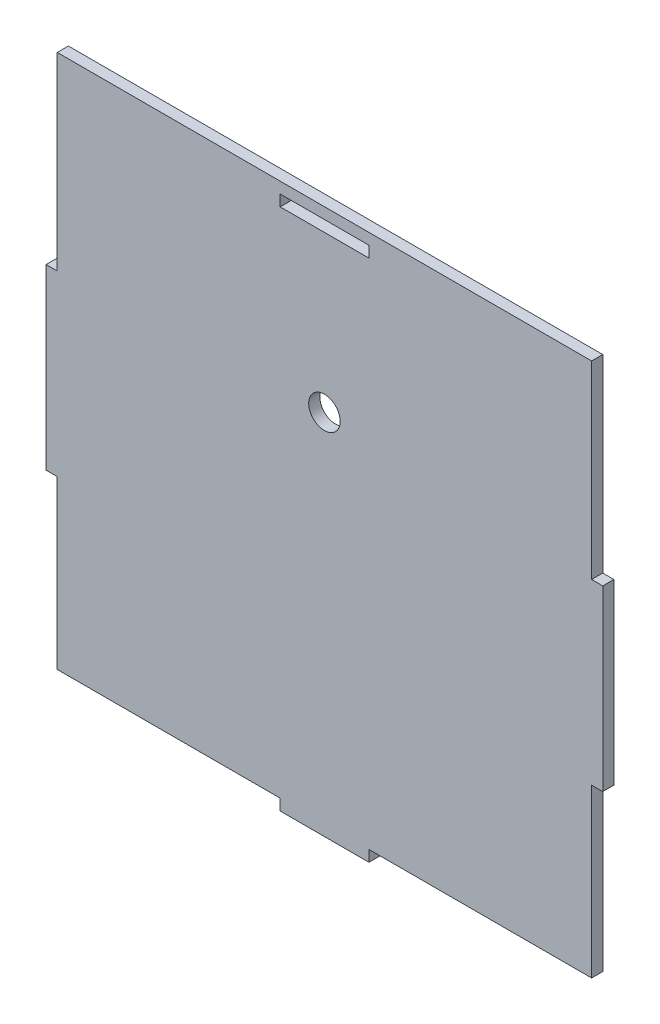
from build123d import *

# Parameters (mm, degrees)
SKETCH1_R           = 4.490128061
SKETCH1_W           = 25.4
SKETCH1_H           = 3.175
BOSS_EXTRUDE1_DEPTH = 3.175


with BuildPart() as part:
    # Sketch1 → Boss-Extrude1 (new body)
    with BuildSketch(Plane.XY):
        Polygon((-30.458063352, -74.819460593), (-30.458063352, -122.444460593), (33.041936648, -122.444460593), (33.041936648, -125.619460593), (58.441936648, -125.619460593), (58.441936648, -122.444460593), (121.941936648, -122.444460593), (121.941936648, -74.819460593), (125.116936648, -74.819460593), (125.116936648, -24.019460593), (121.941936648, -24.019460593), (121.941936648, 29.955539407), (-30.458063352, 29.955539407), (-30.458063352, -24.019460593), (-33.633063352, -24.019460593), (-33.633063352, -74.819460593), align=None)
        with Locations((45.741936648, -20.844460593)):
            Circle(SKETCH1_R, mode=Mode.SUBTRACT)
        with Locations((45.82136132, 25.193039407)):
            Rectangle(SKETCH1_W, SKETCH1_H, mode=Mode.SUBTRACT)
    extrude(amount=BOSS_EXTRUDE1_DEPTH)


solid = part.part
